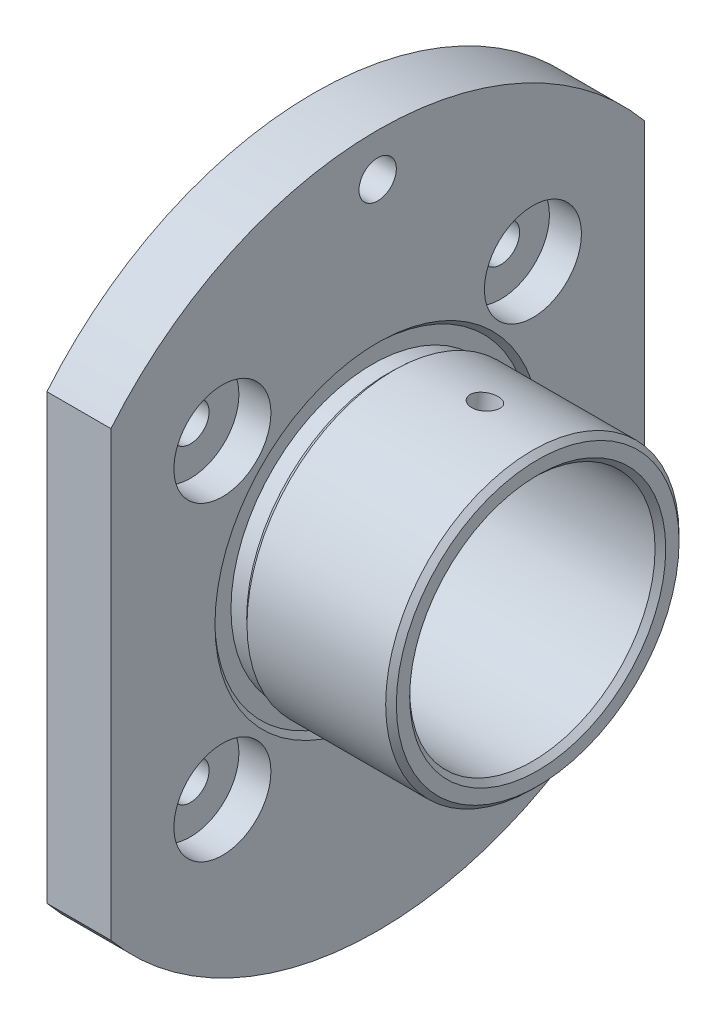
from build123d import *

# Parameters (mm, degrees)
CHAMFER_1_SIZE      = 1
M6X1_0_1_D          = 5
M6X1_0_1_DEPTH      = 15
M6X1_0_1_TIP        = 1.502151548
SKETCH_3_R          = 3.5
CUT_EXTRUDE_1_DEPTH = 20
SKETCH_4_R          = 9.093086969
CUT_EXTRUDE_2_DEPTH = 6
CUT_EXTRUDE_3_DEPTH = 56


with BuildPart() as part:
    # Sketch 1 → Revolve 1 (revolve)
    with BuildSketch(Plane.XY, mode=Mode.PRIVATE) as revolve_1_sk:
        Polygon((-54.751947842, 23), (-54.751947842, 35), (-51.751947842, 35), (-51.751947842, 65), (-39.751947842, 65), (-39.751947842, 30.5), (-40.751947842, 29.55113735), (-40.751947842, 26.5), (-37.805841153, 26.5), (-36.751947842, 27.5), (-9.751947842, 27.5), (-9.751947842, 23), align=None)
    revolve(revolve_1_sk.sketch.rotate(Axis((-67.22485018, 0, 0), (1, 0, 0)), 90), axis=Axis((-67.22485018, 0, 0), (1, 0, 0)))

    # Chamfer 1
    chamfer_1_edges = [part.edges().sort_by_distance(p)[0] for p in [
        (-9.751947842, 0, -27.5),
        (-9.751947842, 0, -23),
        (-54.751947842, 0, -23),
    ]]
    chamfer(chamfer_1_edges, length=CHAMFER_1_SIZE)

    # M6x1.0 _1
    with Locations(Plane(origin=(-23.40469317, 27.239737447, -3.774480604), x_dir=(0, 0.137253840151, 0.990535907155), z_dir=(0, 0.990535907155, -0.137253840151))):
        with Locations((0, 0)):
            Hole(M6X1_0_1_D / 2, depth=M6X1_0_1_DEPTH)
            with Locations((0, 0, -(M6X1_0_1_DEPTH + M6X1_0_1_TIP / 2))):  # 118° drill point
                Cone(0, M6X1_0_1_D / 2, M6X1_0_1_TIP, mode=Mode.SUBTRACT)

    # Sketch 3 → Cut-Extrude 1 (cut)
    with BuildSketch(Plane(origin=(-39.751947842, 0, 0), x_dir=(0, 0, -1), z_dir=(1, 0, 0))):
        with Locations((0, 57)):
            Circle(SKETCH_3_R)
        with Locations((-29.103625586, 29.103625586)):
            Circle(SKETCH_3_R)
        with Locations((29.103625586, 29.103625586)):
            Circle(SKETCH_3_R)
        with Locations((29.103625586, -29.103625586)):
            Circle(SKETCH_3_R)
        with Locations((-29.103625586, -29.103625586)):
            Circle(SKETCH_3_R)
    extrude(amount=-CUT_EXTRUDE_1_DEPTH, mode=Mode.SUBTRACT)

    # Sketch 4 → Cut-Extrude 2 (cut)
    with BuildSketch(Plane(origin=(-39.751947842, 0, 0), x_dir=(0, 0, -1), z_dir=(1, 0, 0))):
        with Locations((-29.103625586, 29.103625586)):
            Circle(SKETCH_4_R)
        with Locations((29.103625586, 29.103625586)):
            Circle(SKETCH_4_R)
        with Locations((29.103625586, -29.103625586)):
            Circle(SKETCH_4_R)
        with Locations((-29.103625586, -29.103625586)):
            Circle(SKETCH_4_R)
    extrude(amount=-CUT_EXTRUDE_2_DEPTH, mode=Mode.SUBTRACT)

    # Sketch 5 → Cut-Extrude 3 (cut)
    with BuildSketch(Plane(origin=(0, 0, 0), x_dir=(0, 0, -1), z_dir=(1, 0, 0))):
        Polygon((-50, 59.215129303), (-50, -53.196894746), (-89.548398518, 5.910766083), align=None)
        Polygon((50, -53.196894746), (89.548398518, 5.910766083), (50, 59.215129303), align=None)
    extrude(amount=-CUT_EXTRUDE_3_DEPTH, mode=Mode.SUBTRACT)


solid = part.part
